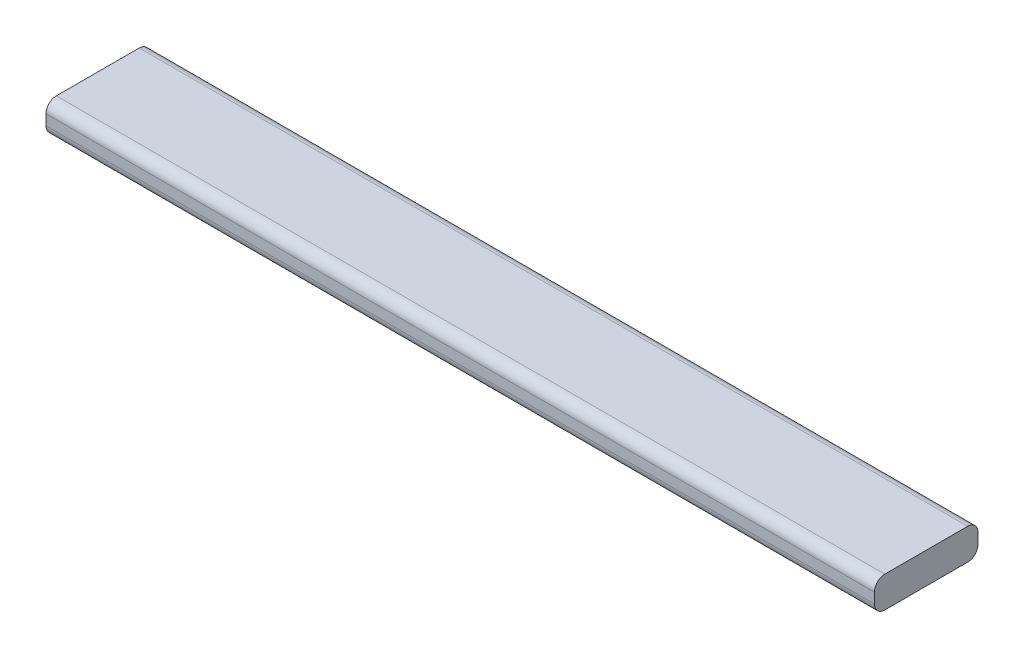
ISO-10303-21;
HEADER;
FILE_DESCRIPTION(('STEP AP214'),'2;1');
FILE_NAME('part.step','',(''),(''),'','','');
FILE_SCHEMA(('AUTOMOTIVE_DESIGN { 1 0 10303 214 1 1 1 1 }'));
ENDSEC;
DATA;
#1=APPLICATION_CONTEXT('core data for automotive mechanical design processes');
#2=APPLICATION_PROTOCOL_DEFINITION('international standard','automotive_design',2000,#1);
#3=PRODUCT_CONTEXT('',#1,'mechanical');
#4=PRODUCT('Part','Part','',(#3));
#5=PRODUCT_RELATED_PRODUCT_CATEGORY('part','',(#4));
#6=PRODUCT_DEFINITION_FORMATION('','',#4);
#7=PRODUCT_DEFINITION_CONTEXT('part definition',#1,'design');
#8=PRODUCT_DEFINITION('design','',#6,#7);
#9=PRODUCT_DEFINITION_SHAPE('','',#8);
#10=(LENGTH_UNIT() NAMED_UNIT(*) SI_UNIT(.MILLI.,.METRE.));
#11=(NAMED_UNIT(*) PLANE_ANGLE_UNIT() SI_UNIT($,.RADIAN.));
#12=(NAMED_UNIT(*) SI_UNIT($,.STERADIAN.) SOLID_ANGLE_UNIT());
#13=UNCERTAINTY_MEASURE_WITH_UNIT(LENGTH_MEASURE(1.E-05),#10,'distance_accuracy_value','');
#14=(GEOMETRIC_REPRESENTATION_CONTEXT(3) GLOBAL_UNCERTAINTY_ASSIGNED_CONTEXT((#13)) GLOBAL_UNIT_ASSIGNED_CONTEXT((#10,
#11,#12)) REPRESENTATION_CONTEXT('',''));
#15=CARTESIAN_POINT('',(0.,0.,0.));
#16=DIRECTION('',(0.,0.,1.));
#17=DIRECTION('',(1.,0.,0.));
#18=AXIS2_PLACEMENT_3D('',#15,#16,#17);
#19=CARTESIAN_POINT('',(574.295946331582,0.,0.));
#20=DIRECTION('',(0.,0.,1.));
#21=DIRECTION('',(1.,0.,0.));
#22=AXIS2_PLACEMENT_3D('',#19,#20,#21);
#23=PLANE('',#22);
#24=DIRECTION('',(0.,1.,0.));
#25=VECTOR('',#24,1.);
#26=CARTESIAN_POINT('',(0.,0.,0.));
#27=LINE('',#26,#25);
#28=CARTESIAN_POINT('',(0.,6.35,0.));
#29=VERTEX_POINT('',#28);
#30=CARTESIAN_POINT('',(0.,12.7,0.));
#31=VERTEX_POINT('',#30);
#32=EDGE_CURVE('E175',#29,#31,#27,.T.);
#33=ORIENTED_EDGE('',*,*,#32,.T.);
#34=DIRECTION('',(-1.,0.,0.));
#35=VECTOR('',#34,1.);
#36=CARTESIAN_POINT('',(574.295946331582,12.7,0.));
#37=LINE('',#36,#35);
#38=CARTESIAN_POINT('',(508.,12.7,0.));
#39=VERTEX_POINT('',#38);
#40=EDGE_CURVE('E56',#31,#39,#37,.F.);
#41=ORIENTED_EDGE('',*,*,#40,.T.);
#42=DIRECTION('',(0.,1.,0.));
#43=VECTOR('',#42,1.);
#44=CARTESIAN_POINT('',(508.,0.,0.));
#45=LINE('',#44,#43);
#46=CARTESIAN_POINT('',(508.,6.35,0.));
#47=VERTEX_POINT('',#46);
#48=EDGE_CURVE('E169',#47,#39,#45,.T.);
#49=ORIENTED_EDGE('',*,*,#48,.F.);
#50=DIRECTION('',(-1.,0.,0.));
#51=VECTOR('',#50,1.);
#52=CARTESIAN_POINT('',(574.295946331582,6.35,0.));
#53=LINE('',#52,#51);
#54=EDGE_CURVE('E117',#47,#29,#53,.T.);
#55=ORIENTED_EDGE('',*,*,#54,.T.);
#56=EDGE_LOOP('',(#33,#41,#49,#55));
#57=FACE_BOUND('',#56,.T.);
#58=ADVANCED_FACE('F41',(#57),#23,.F.);
#59=CARTESIAN_POINT('',(574.295946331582,19.05,0.));
#60=DIRECTION('',(0.,-1.,0.));
#61=DIRECTION('',(0.,0.,-1.));
#62=AXIS2_PLACEMENT_3D('',#59,#60,#61);
#63=PLANE('',#62);
#64=DIRECTION('',(0.,0.,1.));
#65=VECTOR('',#64,1.);
#66=CARTESIAN_POINT('',(0.,19.05,0.));
#67=LINE('',#66,#65);
#68=CARTESIAN_POINT('',(0.,19.05,6.35));
#69=VERTEX_POINT('',#68);
#70=CARTESIAN_POINT('',(0.,19.05,57.15));
#71=VERTEX_POINT('',#70);
#72=EDGE_CURVE('E170',#69,#71,#67,.T.);
#73=ORIENTED_EDGE('',*,*,#72,.T.);
#74=DIRECTION('',(-1.,0.,0.));
#75=VECTOR('',#74,1.);
#76=CARTESIAN_POINT('',(574.295946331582,19.05,57.15));
#77=LINE('',#76,#75);
#78=CARTESIAN_POINT('',(508.,19.05,57.15));
#79=VERTEX_POINT('',#78);
#80=EDGE_CURVE('E145',#71,#79,#77,.F.);
#81=ORIENTED_EDGE('',*,*,#80,.T.);
#82=DIRECTION('',(0.,0.,1.));
#83=VECTOR('',#82,1.);
#84=CARTESIAN_POINT('',(508.,19.05,0.));
#85=LINE('',#84,#83);
#86=CARTESIAN_POINT('',(508.,19.05,6.35));
#87=VERTEX_POINT('',#86);
#88=EDGE_CURVE('E113',#87,#79,#85,.T.);
#89=ORIENTED_EDGE('',*,*,#88,.F.);
#90=DIRECTION('',(-1.,0.,0.));
#91=VECTOR('',#90,1.);
#92=CARTESIAN_POINT('',(574.295946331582,19.05,6.35));
#93=LINE('',#92,#91);
#94=EDGE_CURVE('E142',#87,#69,#93,.T.);
#95=ORIENTED_EDGE('',*,*,#94,.T.);
#96=EDGE_LOOP('',(#73,#81,#89,#95));
#97=FACE_BOUND('',#96,.T.);
#98=ADVANCED_FACE('F185',(#97),#63,.F.);
#99=CARTESIAN_POINT('',(574.295946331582,0.,63.5));
#100=DIRECTION('',(0.,0.,-1.));
#101=DIRECTION('',(-1.,0.,0.));
#102=AXIS2_PLACEMENT_3D('',#99,#100,#101);
#103=PLANE('',#102);
#104=DIRECTION('',(0.,-1.,0.));
#105=VECTOR('',#104,1.);
#106=CARTESIAN_POINT('',(508.,0.,63.5));
#107=LINE('',#106,#105);
#108=CARTESIAN_POINT('',(508.,12.7,63.5));
#109=VERTEX_POINT('',#108);
#110=CARTESIAN_POINT('',(508.,6.34999999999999,63.5));
#111=VERTEX_POINT('',#110);
#112=EDGE_CURVE('E110',#109,#111,#107,.T.);
#113=ORIENTED_EDGE('',*,*,#112,.F.);
#114=DIRECTION('',(-1.,0.,0.));
#115=VECTOR('',#114,1.);
#116=CARTESIAN_POINT('',(574.295946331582,12.7,63.5));
#117=LINE('',#116,#115);
#118=CARTESIAN_POINT('',(0.,12.7,63.5));
#119=VERTEX_POINT('',#118);
#120=EDGE_CURVE('E124',#109,#119,#117,.T.);
#121=ORIENTED_EDGE('',*,*,#120,.T.);
#122=DIRECTION('',(0.,-1.,0.));
#123=VECTOR('',#122,1.);
#124=CARTESIAN_POINT('',(0.,0.,63.5));
#125=LINE('',#124,#123);
#126=CARTESIAN_POINT('',(0.,6.34999999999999,63.5));
#127=VERTEX_POINT('',#126);
#128=EDGE_CURVE('E167',#119,#127,#125,.T.);
#129=ORIENTED_EDGE('',*,*,#128,.T.);
#130=DIRECTION('',(-1.,0.,0.));
#131=VECTOR('',#130,1.);
#132=CARTESIAN_POINT('',(574.295946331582,6.34999999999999,63.5));
#133=LINE('',#132,#131);
#134=EDGE_CURVE('E127',#127,#111,#133,.F.);
#135=ORIENTED_EDGE('',*,*,#134,.T.);
#136=EDGE_LOOP('',(#113,#121,#129,#135));
#137=FACE_BOUND('',#136,.T.);
#138=ADVANCED_FACE('F122',(#137),#103,.F.);
#139=CARTESIAN_POINT('',(574.295946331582,0.,0.));
#140=DIRECTION('',(0.,1.,0.));
#141=DIRECTION('',(0.,0.,1.));
#142=AXIS2_PLACEMENT_3D('',#139,#140,#141);
#143=PLANE('',#142);
#144=DIRECTION('',(0.,0.,-1.));
#145=VECTOR('',#144,1.);
#146=CARTESIAN_POINT('',(0.,0.,0.));
#147=LINE('',#146,#145);
#148=CARTESIAN_POINT('',(0.,0.,57.15));
#149=VERTEX_POINT('',#148);
#150=CARTESIAN_POINT('',(0.,0.,6.35));
#151=VERTEX_POINT('',#150);
#152=EDGE_CURVE('E160',#149,#151,#147,.T.);
#153=ORIENTED_EDGE('',*,*,#152,.T.);
#154=DIRECTION('',(-1.,0.,0.));
#155=VECTOR('',#154,1.);
#156=CARTESIAN_POINT('',(574.295946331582,0.,6.35));
#157=LINE('',#156,#155);
#158=CARTESIAN_POINT('',(508.,0.,6.35));
#159=VERTEX_POINT('',#158);
#160=EDGE_CURVE('E11',#151,#159,#157,.F.);
#161=ORIENTED_EDGE('',*,*,#160,.T.);
#162=DIRECTION('',(0.,0.,-1.));
#163=VECTOR('',#162,1.);
#164=CARTESIAN_POINT('',(508.,0.,0.));
#165=LINE('',#164,#163);
#166=CARTESIAN_POINT('',(508.,0.,57.15));
#167=VERTEX_POINT('',#166);
#168=EDGE_CURVE('E162',#167,#159,#165,.T.);
#169=ORIENTED_EDGE('',*,*,#168,.F.);
#170=DIRECTION('',(-1.,0.,0.));
#171=VECTOR('',#170,1.);
#172=CARTESIAN_POINT('',(574.295946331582,0.,57.15));
#173=LINE('',#172,#171);
#174=EDGE_CURVE('E49',#167,#149,#173,.T.);
#175=ORIENTED_EDGE('',*,*,#174,.T.);
#176=EDGE_LOOP('',(#153,#161,#169,#175));
#177=FACE_BOUND('',#176,.T.);
#178=ADVANCED_FACE('F159',(#177),#143,.F.);
#179=CARTESIAN_POINT('',(0.,0.,0.));
#180=DIRECTION('',(1.,0.,0.));
#181=DIRECTION('',(0.,0.,-1.));
#182=AXIS2_PLACEMENT_3D('',#179,#180,#181);
#183=PLANE('',#182);
#184=ORIENTED_EDGE('',*,*,#128,.F.);
#185=CARTESIAN_POINT('',(0.,12.7,57.15));
#186=DIRECTION('',(1.,0.,0.));
#187=DIRECTION('',(0.,0.,-1.));
#188=AXIS2_PLACEMENT_3D('',#185,#186,#187);
#189=CIRCLE('',#188,6.35);
#190=EDGE_CURVE('E130',#119,#71,#189,.F.);
#191=ORIENTED_EDGE('',*,*,#190,.T.);
#192=ORIENTED_EDGE('',*,*,#72,.F.);
#193=CARTESIAN_POINT('',(0.,12.7,6.35));
#194=DIRECTION('',(1.,0.,0.));
#195=DIRECTION('',(0.,0.,-1.));
#196=AXIS2_PLACEMENT_3D('',#193,#194,#195);
#197=CIRCLE('',#196,6.35);
#198=EDGE_CURVE('E139',#69,#31,#197,.F.);
#199=ORIENTED_EDGE('',*,*,#198,.T.);
#200=ORIENTED_EDGE('',*,*,#32,.F.);
#201=CARTESIAN_POINT('',(0.,6.35,6.35));
#202=DIRECTION('',(1.,0.,0.));
#203=DIRECTION('',(0.,0.,-1.));
#204=AXIS2_PLACEMENT_3D('',#201,#202,#203);
#205=CIRCLE('',#204,6.35);
#206=EDGE_CURVE('E133',#29,#151,#205,.F.);
#207=ORIENTED_EDGE('',*,*,#206,.T.);
#208=ORIENTED_EDGE('',*,*,#152,.F.);
#209=CARTESIAN_POINT('',(0.,6.34999999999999,57.15));
#210=DIRECTION('',(1.,0.,0.));
#211=DIRECTION('',(0.,0.,-1.));
#212=AXIS2_PLACEMENT_3D('',#209,#210,#211);
#213=CIRCLE('',#212,6.35);
#214=EDGE_CURVE('E131',#149,#127,#213,.F.);
#215=ORIENTED_EDGE('',*,*,#214,.T.);
#216=EDGE_LOOP('',(#184,#191,#192,#199,#200,#207,#208,#215));
#217=FACE_BOUND('',#216,.T.);
#218=ADVANCED_FACE('F165',(#217),#183,.F.);
#219=CARTESIAN_POINT('',(508.,0.,0.));
#220=DIRECTION('',(1.,0.,0.));
#221=DIRECTION('',(0.,0.,-1.));
#222=AXIS2_PLACEMENT_3D('',#219,#220,#221);
#223=PLANE('',#222);
#224=ORIENTED_EDGE('',*,*,#88,.T.);
#225=CARTESIAN_POINT('',(508.,12.7,57.15));
#226=DIRECTION('',(1.,0.,0.));
#227=DIRECTION('',(0.,0.,-1.));
#228=AXIS2_PLACEMENT_3D('',#225,#226,#227);
#229=CIRCLE('',#228,6.35);
#230=EDGE_CURVE('E107',#79,#109,#229,.T.);
#231=ORIENTED_EDGE('',*,*,#230,.T.);
#232=ORIENTED_EDGE('',*,*,#112,.T.);
#233=CARTESIAN_POINT('',(508.,6.34999999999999,57.15));
#234=DIRECTION('',(1.,0.,0.));
#235=DIRECTION('',(0.,0.,-1.));
#236=AXIS2_PLACEMENT_3D('',#233,#234,#235);
#237=CIRCLE('',#236,6.35);
#238=EDGE_CURVE('E147',#111,#167,#237,.T.);
#239=ORIENTED_EDGE('',*,*,#238,.T.);
#240=ORIENTED_EDGE('',*,*,#168,.T.);
#241=CARTESIAN_POINT('',(508.,6.35,6.35));
#242=DIRECTION('',(1.,0.,0.));
#243=DIRECTION('',(0.,0.,-1.));
#244=AXIS2_PLACEMENT_3D('',#241,#242,#243);
#245=CIRCLE('',#244,6.35);
#246=EDGE_CURVE('E63',#159,#47,#245,.T.);
#247=ORIENTED_EDGE('',*,*,#246,.T.);
#248=ORIENTED_EDGE('',*,*,#48,.T.);
#249=CARTESIAN_POINT('',(508.,12.7,6.35));
#250=DIRECTION('',(1.,0.,0.));
#251=DIRECTION('',(0.,0.,-1.));
#252=AXIS2_PLACEMENT_3D('',#249,#250,#251);
#253=CIRCLE('',#252,6.35);
#254=EDGE_CURVE('E118',#39,#87,#253,.T.);
#255=ORIENTED_EDGE('',*,*,#254,.T.);
#256=EDGE_LOOP('',(#224,#231,#232,#239,#240,#247,#248,#255));
#257=FACE_BOUND('',#256,.T.);
#258=ADVANCED_FACE('F109',(#257),#223,.T.);
#259=CARTESIAN_POINT('',(574.295946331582,12.7,57.15));
#260=DIRECTION('',(-1.,0.,0.));
#261=DIRECTION('',(0.,0.,1.));
#262=AXIS2_PLACEMENT_3D('',#259,#260,#261);
#263=CYLINDRICAL_SURFACE('',#262,6.35);
#264=ORIENTED_EDGE('',*,*,#230,.F.);
#265=ORIENTED_EDGE('',*,*,#80,.F.);
#266=ORIENTED_EDGE('',*,*,#190,.F.);
#267=ORIENTED_EDGE('',*,*,#120,.F.);
#268=EDGE_LOOP('',(#264,#265,#266,#267));
#269=FACE_BOUND('',#268,.T.);
#270=ADVANCED_FACE('F129',(#269),#263,.T.);
#271=CARTESIAN_POINT('',(574.295946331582,12.7,6.35));
#272=DIRECTION('',(-1.,0.,0.));
#273=DIRECTION('',(0.,0.,1.));
#274=AXIS2_PLACEMENT_3D('',#271,#272,#273);
#275=CYLINDRICAL_SURFACE('',#274,6.35);
#276=ORIENTED_EDGE('',*,*,#254,.F.);
#277=ORIENTED_EDGE('',*,*,#40,.F.);
#278=ORIENTED_EDGE('',*,*,#198,.F.);
#279=ORIENTED_EDGE('',*,*,#94,.F.);
#280=EDGE_LOOP('',(#276,#277,#278,#279));
#281=FACE_BOUND('',#280,.T.);
#282=ADVANCED_FACE('F182',(#281),#275,.T.);
#283=CARTESIAN_POINT('',(574.295946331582,6.35,6.35));
#284=DIRECTION('',(-1.,0.,0.));
#285=DIRECTION('',(0.,0.,1.));
#286=AXIS2_PLACEMENT_3D('',#283,#284,#285);
#287=CYLINDRICAL_SURFACE('',#286,6.35);
#288=ORIENTED_EDGE('',*,*,#246,.F.);
#289=ORIENTED_EDGE('',*,*,#160,.F.);
#290=ORIENTED_EDGE('',*,*,#206,.F.);
#291=ORIENTED_EDGE('',*,*,#54,.F.);
#292=EDGE_LOOP('',(#288,#289,#290,#291));
#293=FACE_BOUND('',#292,.T.);
#294=ADVANCED_FACE('F187',(#293),#287,.T.);
#295=CARTESIAN_POINT('',(574.295946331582,6.34999999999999,57.15));
#296=DIRECTION('',(-1.,0.,0.));
#297=DIRECTION('',(0.,0.,1.));
#298=AXIS2_PLACEMENT_3D('',#295,#296,#297);
#299=CYLINDRICAL_SURFACE('',#298,6.35);
#300=ORIENTED_EDGE('',*,*,#238,.F.);
#301=ORIENTED_EDGE('',*,*,#134,.F.);
#302=ORIENTED_EDGE('',*,*,#214,.F.);
#303=ORIENTED_EDGE('',*,*,#174,.F.);
#304=EDGE_LOOP('',(#300,#301,#302,#303));
#305=FACE_BOUND('',#304,.T.);
#306=ADVANCED_FACE('F43',(#305),#299,.T.);
#307=CLOSED_SHELL('',(#58,#98,#138,#178,#218,#258,#270,#282,#294,#306));
#308=MANIFOLD_SOLID_BREP('B2',#307);
#309=ADVANCED_BREP_SHAPE_REPRESENTATION('',(#18,#308),#14);
#310=SHAPE_DEFINITION_REPRESENTATION(#9,#309);
ENDSEC;
END-ISO-10303-21;
